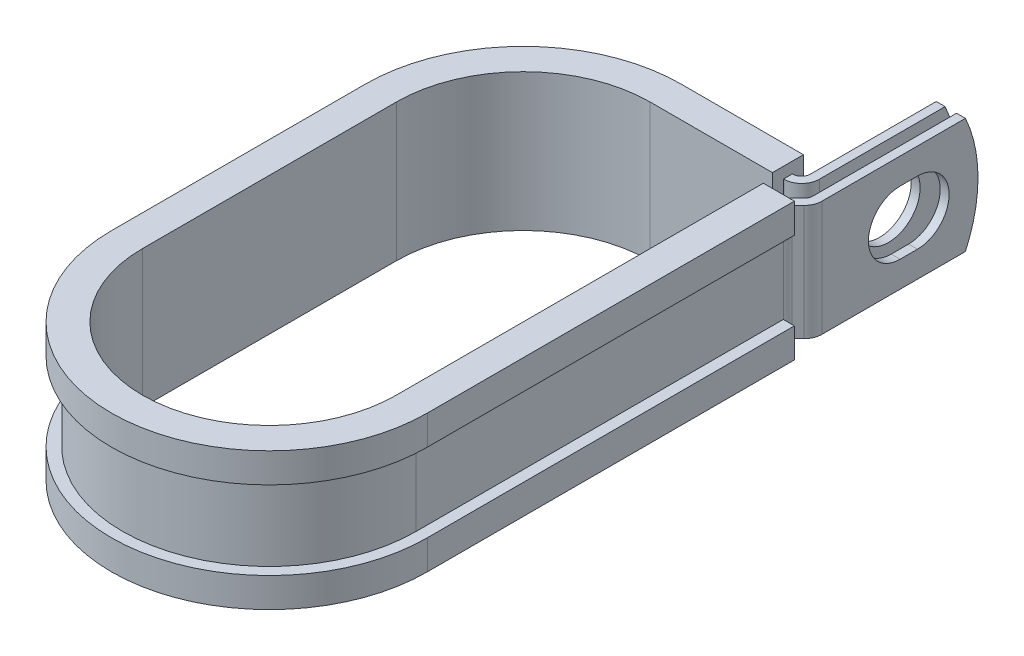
from build123d import *

# Parameters (mm, degrees)
EXTRUDE_THIN1_DEPTH = 7.9375
SKETCH2_R           = 4.3561
CUT_EXTRUDE1_DEPTH  = 1.2192
CUT_EXTRUDE2_DEPTH  = 1.2192
CUT_EXTRUDE3_DEPTH  = 68.594055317


with BuildPart() as part:
    # Sketch1 → Extrude-Thin1 (new, symmetric)
    with BuildSketch(Plane(origin=(0, 0, 0), x_dir=(1, 0, 0), z_dir=(0, 1, 0))):
        with BuildLine():
            Line((20.8839698, 40.4622), (20.8839698, 18.9865))
            ThreePointArc((20.8839698, 18.9865), (20.791163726, 18.519932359), (20.526874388, 18.124395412))
            Line((20.526874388, 18.124395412), (19.700690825, 17.298211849))
            ThreePointArc((19.700690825, 17.298211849), (19.172112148, 16.507137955), (18.9865, 15.574002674))
            Line((18.9865, 15.574002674), (18.9865, 0))
            Line((18.9865, 0), (18.9865, -34.925))
            ThreePointArc((18.9865, -34.925), (0, -53.9115), (-18.9865, -34.925))
            Line((-18.9865, -34.925), (-18.9865, 0))
            ThreePointArc((-18.9865, 0), (-13.425482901, 13.425482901), (0, 18.9865))
            Line((0, 18.9865), (16.8707698, 18.9865))
            ThreePointArc((16.8707698, 18.9865), (18.594978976, 19.700690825), (19.3091698, 21.4249))
            Line((19.3091698, 21.4249), (19.3091698, 40.4622))
            Line((19.3091698, 40.4622), (18.0899698, 40.4622))
            Line((18.0899698, 40.4622), (18.0899698, 21.4249))
            ThreePointArc((18.0899698, 21.4249), (17.732874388, 20.562795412), (16.8707698, 20.2057))
            Line((16.8707698, 20.2057), (0, 20.2057))
            ThreePointArc((0, 20.2057), (-14.287587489, 14.287587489), (-20.2057, 0))
            Line((-20.2057, 0), (-20.2057, -34.925))
            ThreePointArc((-20.2057, -34.925), (0, -55.1307), (20.2057, -34.925))
            Line((20.2057, -34.925), (20.2057, 0))
            Line((20.2057, 0), (20.2057, 15.574002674))
            ThreePointArc((20.2057, 15.574002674), (20.298506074, 16.040570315), (20.562795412, 16.436107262))
            Line((20.562795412, 16.436107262), (21.388978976, 17.262290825))
            ThreePointArc((21.388978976, 17.262290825), (21.917557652, 18.053364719), (22.1031698, 18.9865))
            Line((22.1031698, 18.9865), (22.1031698, 40.4622))
            Line((22.1031698, 40.4622), (20.8839698, 40.4622))
        make_face()
    extrude(amount=EXTRUDE_THIN1_DEPTH, both=True)

    # Sketch2 → Cut-Extrude1 (cut)
    with BuildSketch(Plane.ZY.offset(-18.0899698)):
        with Locations((-30.9372, 0)):
            Circle(SKETCH2_R)
    extrude(amount=-CUT_EXTRUDE1_DEPTH, mode=Mode.SUBTRACT)

    # Sketch3 → Cut-Extrude2 (cut)
    with BuildSketch(Plane(origin=(22.1031698, 0, 0), x_dir=(0, 0, -1), z_dir=(1, 0, 0))):
        with BuildLine():
            Line((29.7434, 4.3561), (32.131, 4.3561))
            ThreePointArc((32.131, 4.3561), (36.4871, 0), (32.131, -4.3561))
            Line((32.131, -4.3561), (29.7434, -4.3561))
            ThreePointArc((29.7434, -4.3561), (25.3873, 0), (29.7434, 4.3561))
        make_face()
    extrude(amount=-CUT_EXTRUDE2_DEPTH, mode=Mode.SUBTRACT)

    # Sketch4 → Cut-Extrude3 (cut, through all)
    with BuildSketch(Plane.ZY.offset(-18.0899698)):
        with BuildLine():
            Line((-38.729780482, 7.9375), (-40.4622, 7.9375))
            Line((-40.4622, 7.9375), (-40.4622, 0))
            ThreePointArc((-40.4622, 0), (-40.024056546, 4.062178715), (-38.729780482, 7.9375))
        make_face()
        with BuildLine():
            ThreePointArc((-38.729780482, -7.9375), (-40.024056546, -4.062178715), (-40.4622, 0))
            Line((-40.4622, 0), (-40.4622, -7.9375))
            Line((-40.4622, -7.9375), (-38.729780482, -7.9375))
        make_face()
    extrude(amount=-CUT_EXTRUDE3_DEPTH, mode=Mode.SUBTRACT)

    # Sweep1: sweep along a path in Sketch6
    with BuildLine(Plane(origin=(0, 7.9375, 0), x_dir=(1, 0, 0), z_dir=(0, 1, 0))) as sweep1_path:
        Line((17.4625, 15.574002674), (17.4625, 0))
        Line((17.4625, 0), (17.4625, -34.925))
        ThreePointArc((17.4625, -34.925), (0, -52.3875), (-17.4625, -34.925))
        Line((-17.4625, -34.925), (-17.4625, 0))
        ThreePointArc((-17.4625, 0), (-12.347852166, 12.347852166), (0, 17.4625))
        Line((0, 17.4625), (16.8199698, 17.4625))
    # Sketch5 → Sweep1 (sweep)
    with BuildSketch(Plane(origin=(0, 0, -15.574002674), x_dir=(-1, 0, 0), z_dir=(0, 0, -1))):
        Polygon((-20.2057, 7.9375), (-18.9865, 7.9375), (-18.9865, -7.9375), (-20.2057, -7.9375), (-20.2057, -5.3975), (-21.7297, -5.3975), (-21.7297, -9.4615), (-17.4625, -9.4615), (-17.4625, 9.4615), (-21.7297, 9.4615), (-21.7297, 5.3975), (-20.2057, 5.3975), align=None)
    sweep(path=sweep1_path.line)


solid = part.part
